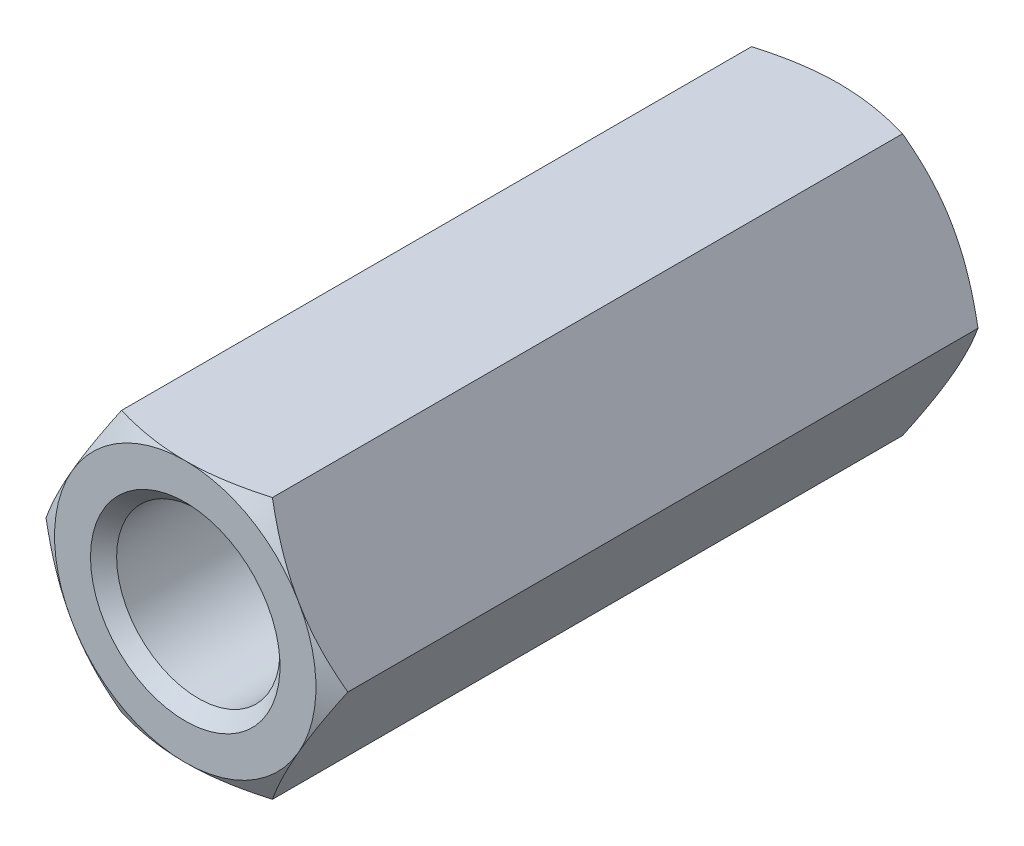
ISO-10303-21;
HEADER;
FILE_DESCRIPTION(('STEP AP214'),'2;1');
FILE_NAME('part.step','',(''),(''),'','','');
FILE_SCHEMA(('AUTOMOTIVE_DESIGN { 1 0 10303 214 1 1 1 1 }'));
ENDSEC;
DATA;
#1=APPLICATION_CONTEXT('core data for automotive mechanical design processes');
#2=APPLICATION_PROTOCOL_DEFINITION('international standard','automotive_design',2000,#1);
#3=PRODUCT_CONTEXT('',#1,'mechanical');
#4=PRODUCT('Part','Part','',(#3));
#5=PRODUCT_RELATED_PRODUCT_CATEGORY('part','',(#4));
#6=PRODUCT_DEFINITION_FORMATION('','',#4);
#7=PRODUCT_DEFINITION_CONTEXT('part definition',#1,'design');
#8=PRODUCT_DEFINITION('design','',#6,#7);
#9=PRODUCT_DEFINITION_SHAPE('','',#8);
#10=(LENGTH_UNIT() NAMED_UNIT(*) SI_UNIT(.MILLI.,.METRE.));
#11=(NAMED_UNIT(*) PLANE_ANGLE_UNIT() SI_UNIT($,.RADIAN.));
#12=(NAMED_UNIT(*) SI_UNIT($,.STERADIAN.) SOLID_ANGLE_UNIT());
#13=UNCERTAINTY_MEASURE_WITH_UNIT(LENGTH_MEASURE(1.E-05),#10,'distance_accuracy_value','');
#14=(GEOMETRIC_REPRESENTATION_CONTEXT(3) GLOBAL_UNCERTAINTY_ASSIGNED_CONTEXT((#13)) GLOBAL_UNIT_ASSIGNED_CONTEXT((#10,
#11,#12)) REPRESENTATION_CONTEXT('',''));
#15=CARTESIAN_POINT('',(0.,0.,0.));
#16=DIRECTION('',(0.,0.,1.));
#17=DIRECTION('',(1.,0.,0.));
#18=AXIS2_PLACEMENT_3D('',#15,#16,#17);
#19=CARTESIAN_POINT('',(4.61880215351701,0.,-10.));
#20=DIRECTION('',(0.866025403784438,0.5,0.));
#21=DIRECTION('',(-0.5,0.866025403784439,0.));
#22=AXIS2_PLACEMENT_3D('',#19,#20,#21);
#23=PLANE('',#22);
#24=CARTESIAN_POINT('',(4.61891762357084,-0.000199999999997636,9.64266774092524));
#25=CARTESIAN_POINT('',(4.51743148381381,0.175579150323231,9.70128212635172));
#26=CARTESIAN_POINT('',(4.41506932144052,0.352875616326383,9.75458967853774));
#27=CARTESIAN_POINT('',(4.20857250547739,0.710538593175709,9.8476383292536));
#28=CARTESIAN_POINT('',(4.10443418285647,0.890911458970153,9.8873465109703));
#29=CARTESIAN_POINT('',(3.89744813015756,1.24942181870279,9.94915778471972));
#30=CARTESIAN_POINT('',(3.79463224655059,1.42750415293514,9.97167226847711));
#31=CARTESIAN_POINT('',(3.58851671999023,1.78450671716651,9.99854937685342));
#32=CARTESIAN_POINT('',(3.48521782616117,1.9634256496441,10.0029342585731));
#33=CARTESIAN_POINT('',(3.29219970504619,2.29774284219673,9.99380992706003));
#34=CARTESIAN_POINT('',(3.20245157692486,2.45319115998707,9.98254104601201));
#35=CARTESIAN_POINT('',(3.02354002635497,2.76307505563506,9.94682600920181));
#36=CARTESIAN_POINT('',(2.93437722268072,2.91750956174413,9.92236765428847));
#37=CARTESIAN_POINT('',(2.75509682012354,3.22803232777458,9.86122393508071));
#38=CARTESIAN_POINT('',(2.6650019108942,3.3840812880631,9.82427939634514));
#39=CARTESIAN_POINT('',(2.48615580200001,3.69385183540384,9.74042992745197));
#40=CARTESIAN_POINT('',(2.39740231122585,3.84757739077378,9.69354469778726));
#41=CARTESIAN_POINT('',(2.30928560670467,4.0002,9.64266774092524));
#42=B_SPLINE_CURVE_WITH_KNOTS('',3,(#24,#25,#26,#27,#28,#29,#30,#31,#32,#33,#34,#35,#36,#37,#38,
#39,#40,#41),.UNSPECIFIED.,.F.,.F.,(4,2,2,2,2,2,2,2,4),(0.,0.634047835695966,1.26961969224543,
1.88946157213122,2.50854226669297,3.04757825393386,3.58711366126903,4.13861653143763,
4.68903648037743),.UNSPECIFIED.);
#43=CARTESIAN_POINT('',(4.61880215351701,0.,9.64273441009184));
#44=VERTEX_POINT('',#43);
#45=CARTESIAN_POINT('',(3.46410161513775,2.,10.));
#46=VERTEX_POINT('',#45);
#47=EDGE_CURVE('E127',#44,#46,#42,.T.);
#48=ORIENTED_EDGE('',*,*,#47,.F.);
#49=DIRECTION('',(0.,0.,1.));
#50=VECTOR('',#49,1.);
#51=CARTESIAN_POINT('',(4.61880215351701,0.,-10.));
#52=LINE('',#51,#50);
#53=CARTESIAN_POINT('',(4.61880215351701,0.,-9.64273441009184));
#54=VERTEX_POINT('',#53);
#55=EDGE_CURVE('E544',#54,#44,#52,.T.);
#56=ORIENTED_EDGE('',*,*,#55,.F.);
#57=CARTESIAN_POINT('',(4.61891762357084,-0.000199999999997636,-9.64266774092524));
#58=CARTESIAN_POINT('',(4.51743148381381,0.175579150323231,-9.70128212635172));
#59=CARTESIAN_POINT('',(4.41506932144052,0.352875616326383,-9.75458967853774));
#60=CARTESIAN_POINT('',(4.20857250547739,0.710538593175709,-9.8476383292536));
#61=CARTESIAN_POINT('',(4.10443418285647,0.890911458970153,-9.8873465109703));
#62=CARTESIAN_POINT('',(3.89744813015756,1.24942181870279,-9.94915778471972));
#63=CARTESIAN_POINT('',(3.79463224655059,1.42750415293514,-9.97167226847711));
#64=CARTESIAN_POINT('',(3.58851671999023,1.78450671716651,-9.99854937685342));
#65=CARTESIAN_POINT('',(3.48521782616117,1.9634256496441,-10.0029342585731));
#66=CARTESIAN_POINT('',(3.29219970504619,2.29774284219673,-9.99380992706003));
#67=CARTESIAN_POINT('',(3.20245157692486,2.45319115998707,-9.98254104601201));
#68=CARTESIAN_POINT('',(3.02354002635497,2.76307505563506,-9.94682600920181));
#69=CARTESIAN_POINT('',(2.93437722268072,2.91750956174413,-9.92236765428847));
#70=CARTESIAN_POINT('',(2.75509682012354,3.22803232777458,-9.86122393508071));
#71=CARTESIAN_POINT('',(2.6650019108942,3.3840812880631,-9.82427939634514));
#72=CARTESIAN_POINT('',(2.48615580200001,3.69385183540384,-9.74042992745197));
#73=CARTESIAN_POINT('',(2.39740231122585,3.84757739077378,-9.69354469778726));
#74=CARTESIAN_POINT('',(2.30928560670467,4.0002,-9.64266774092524));
#75=B_SPLINE_CURVE_WITH_KNOTS('',3,(#57,#58,#59,#60,#61,#62,#63,#64,#65,#66,#67,#68,#69,#70,#71,
#72,#73,#74),.UNSPECIFIED.,.F.,.F.,(4,2,2,2,2,2,2,2,4),(0.,0.634047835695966,1.26961969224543,
1.88946157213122,2.50854226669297,3.04757825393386,3.58711366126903,4.13861653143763,
4.68903648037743),.UNSPECIFIED.);
#76=CARTESIAN_POINT('',(3.46410161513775,2.,-10.));
#77=VERTEX_POINT('',#76);
#78=EDGE_CURVE('E546',#54,#77,#75,.T.);
#79=ORIENTED_EDGE('',*,*,#78,.T.);
#80=CARTESIAN_POINT('',(2.3094010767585,4.,-9.64273441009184));
#81=VERTEX_POINT('',#80);
#82=EDGE_CURVE('E268',#77,#81,#75,.T.);
#83=ORIENTED_EDGE('',*,*,#82,.T.);
#84=DIRECTION('',(0.,0.,1.));
#85=VECTOR('',#84,1.);
#86=CARTESIAN_POINT('',(2.3094010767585,4.,-10.));
#87=LINE('',#86,#85);
#88=CARTESIAN_POINT('',(2.3094010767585,4.,9.64273441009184));
#89=VERTEX_POINT('',#88);
#90=EDGE_CURVE('E159',#81,#89,#87,.T.);
#91=ORIENTED_EDGE('',*,*,#90,.T.);
#92=EDGE_CURVE('E140',#46,#89,#42,.T.);
#93=ORIENTED_EDGE('',*,*,#92,.F.);
#94=EDGE_LOOP('',(#48,#56,#79,#83,#91,#93));
#95=FACE_BOUND('',#94,.T.);
#96=ADVANCED_FACE('F41',(#95),#23,.T.);
#97=CARTESIAN_POINT('',(2.3094010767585,-4.,-10.));
#98=DIRECTION('',(0.866025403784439,-0.5,0.));
#99=DIRECTION('',(0.5,0.866025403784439,0.));
#100=AXIS2_PLACEMENT_3D('',#97,#98,#99);
#101=PLANE('',#100);
#102=CARTESIAN_POINT('',(2.30928560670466,-4.0002,9.64266774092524));
#103=CARTESIAN_POINT('',(2.4107717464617,-3.82442084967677,9.70128212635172));
#104=CARTESIAN_POINT('',(2.51313390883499,-3.64712438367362,9.75458967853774));
#105=CARTESIAN_POINT('',(2.71963072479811,-3.28946140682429,9.8476383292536));
#106=CARTESIAN_POINT('',(2.82376904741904,-3.10908854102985,9.8873465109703));
#107=CARTESIAN_POINT('',(3.03075510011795,-2.75057818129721,9.94915778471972));
#108=CARTESIAN_POINT('',(3.13357098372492,-2.57249584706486,9.97167226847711));
#109=CARTESIAN_POINT('',(3.33968651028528,-2.21549328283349,9.99854937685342));
#110=CARTESIAN_POINT('',(3.44298540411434,-2.0365743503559,10.0029342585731));
#111=CARTESIAN_POINT('',(3.63600352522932,-1.70225715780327,9.99380992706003));
#112=CARTESIAN_POINT('',(3.72575165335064,-1.54680884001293,9.98254104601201));
#113=CARTESIAN_POINT('',(3.90466320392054,-1.23692494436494,9.94682600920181));
#114=CARTESIAN_POINT('',(3.99382600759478,-1.08249043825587,9.92236765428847));
#115=CARTESIAN_POINT('',(4.17310641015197,-0.771967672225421,9.86122393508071));
#116=CARTESIAN_POINT('',(4.26320131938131,-0.615918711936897,9.82427939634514));
#117=CARTESIAN_POINT('',(4.4420474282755,-0.306148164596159,9.74042992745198));
#118=CARTESIAN_POINT('',(4.53080091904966,-0.152422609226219,9.69354469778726));
#119=CARTESIAN_POINT('',(4.61891762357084,0.00020000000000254,9.64266774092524));
#120=B_SPLINE_CURVE_WITH_KNOTS('',3,(#102,#103,#104,#105,#106,#107,#108,#109,#110,#111,#112,
#113,#114,#115,#116,#117,#118,#119),.UNSPECIFIED.,.F.,.F.,(4,2,2,2,2,2,2,2,4),(0.,
0.634047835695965,1.26961969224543,1.88946157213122,2.50854226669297,3.04757825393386,
3.58711366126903,4.13861653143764,4.68903648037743),.UNSPECIFIED.);
#121=CARTESIAN_POINT('',(2.3094010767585,-4.,9.64273441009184));
#122=VERTEX_POINT('',#121);
#123=CARTESIAN_POINT('',(3.46410161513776,-2.,10.));
#124=VERTEX_POINT('',#123);
#125=EDGE_CURVE('E534',#122,#124,#120,.T.);
#126=ORIENTED_EDGE('',*,*,#125,.F.);
#127=DIRECTION('',(0.,0.,1.));
#128=VECTOR('',#127,1.);
#129=CARTESIAN_POINT('',(2.3094010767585,-4.,-10.));
#130=LINE('',#129,#128);
#131=CARTESIAN_POINT('',(2.3094010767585,-4.,-9.64273441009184));
#132=VERTEX_POINT('',#131);
#133=EDGE_CURVE('E282',#132,#122,#130,.T.);
#134=ORIENTED_EDGE('',*,*,#133,.F.);
#135=CARTESIAN_POINT('',(2.30928560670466,-4.0002,-9.64266774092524));
#136=CARTESIAN_POINT('',(2.4107717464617,-3.82442084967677,-9.70128212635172));
#137=CARTESIAN_POINT('',(2.51313390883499,-3.64712438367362,-9.75458967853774));
#138=CARTESIAN_POINT('',(2.71963072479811,-3.28946140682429,-9.8476383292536));
#139=CARTESIAN_POINT('',(2.82376904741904,-3.10908854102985,-9.8873465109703));
#140=CARTESIAN_POINT('',(3.03075510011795,-2.75057818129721,-9.94915778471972));
#141=CARTESIAN_POINT('',(3.13357098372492,-2.57249584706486,-9.97167226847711));
#142=CARTESIAN_POINT('',(3.33968651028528,-2.21549328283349,-9.99854937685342));
#143=CARTESIAN_POINT('',(3.44298540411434,-2.0365743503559,-10.0029342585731));
#144=CARTESIAN_POINT('',(3.63600352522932,-1.70225715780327,-9.99380992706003));
#145=CARTESIAN_POINT('',(3.72575165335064,-1.54680884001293,-9.98254104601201));
#146=CARTESIAN_POINT('',(3.90466320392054,-1.23692494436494,-9.94682600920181));
#147=CARTESIAN_POINT('',(3.99382600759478,-1.08249043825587,-9.92236765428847));
#148=CARTESIAN_POINT('',(4.17310641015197,-0.771967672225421,-9.86122393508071));
#149=CARTESIAN_POINT('',(4.26320131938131,-0.615918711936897,-9.82427939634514));
#150=CARTESIAN_POINT('',(4.4420474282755,-0.306148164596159,-9.74042992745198));
#151=CARTESIAN_POINT('',(4.53080091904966,-0.152422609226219,-9.69354469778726));
#152=CARTESIAN_POINT('',(4.61891762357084,0.00020000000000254,-9.64266774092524));
#153=B_SPLINE_CURVE_WITH_KNOTS('',3,(#135,#136,#137,#138,#139,#140,#141,#142,#143,#144,#145,
#146,#147,#148,#149,#150,#151,#152),.UNSPECIFIED.,.F.,.F.,(4,2,2,2,2,2,2,2,4),(0.,
0.634047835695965,1.26961969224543,1.88946157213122,2.50854226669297,3.04757825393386,
3.58711366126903,4.13861653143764,4.68903648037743),.UNSPECIFIED.);
#154=CARTESIAN_POINT('',(3.46410161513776,-2.,-10.));
#155=VERTEX_POINT('',#154);
#156=EDGE_CURVE('E545',#132,#155,#153,.T.);
#157=ORIENTED_EDGE('',*,*,#156,.T.);
#158=EDGE_CURVE('E283',#155,#54,#153,.T.);
#159=ORIENTED_EDGE('',*,*,#158,.T.);
#160=ORIENTED_EDGE('',*,*,#55,.T.);
#161=EDGE_CURVE('E132',#124,#44,#120,.T.);
#162=ORIENTED_EDGE('',*,*,#161,.F.);
#163=EDGE_LOOP('',(#126,#134,#157,#159,#160,#162));
#164=FACE_BOUND('',#163,.T.);
#165=ADVANCED_FACE('F253',(#164),#101,.T.);
#166=CARTESIAN_POINT('',(-2.3094010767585,-4.,-10.));
#167=DIRECTION('',(0.,-1.,0.));
#168=DIRECTION('',(0.,0.,-1.));
#169=AXIS2_PLACEMENT_3D('',#166,#167,#168);
#170=PLANE('',#169);
#171=CARTESIAN_POINT('',(-17.8108056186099,-4.,1.7701917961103));
#172=CARTESIAN_POINT('',(-17.4231435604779,-4.,1.98856120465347));
#173=CARTESIAN_POINT('',(-17.0353413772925,-4.,2.20668239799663));
#174=CARTESIAN_POINT('',(-16.2593791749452,-4.,2.64229075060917));
#175=CARTESIAN_POINT('',(-15.8712191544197,-4.,2.85977790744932));
#176=CARTESIAN_POINT('',(-15.0943874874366,-4.,3.294023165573));
#177=CARTESIAN_POINT('',(-14.7057157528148,-4.,3.51078110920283));
#178=CARTESIAN_POINT('',(-13.9278336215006,-4.,3.9433271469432));
#179=CARTESIAN_POINT('',(-13.5386232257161,-4.,4.1591152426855));
#180=CARTESIAN_POINT('',(-12.7617286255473,-4.,4.58823972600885));
#181=CARTESIAN_POINT('',(-12.3740482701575,-4.,4.80158307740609));
#182=CARTESIAN_POINT('',(-11.5978227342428,-4.,5.2266901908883));
#183=CARTESIAN_POINT('',(-11.2092775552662,-4.,5.43845395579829));
#184=CARTESIAN_POINT('',(-10.431096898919,-4.,5.85986514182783));
#185=CARTESIAN_POINT('',(-10.0414615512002,-4.,6.06951280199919));
#186=CARTESIAN_POINT('',(-9.26067086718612,-4.,6.48595211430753));
#187=CARTESIAN_POINT('',(-8.86951554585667,-4.,6.69274379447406));
#188=CARTESIAN_POINT('',(-8.07519273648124,-4.,7.10750777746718));
#189=CARTESIAN_POINT('',(-7.67197156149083,-4.,7.31537776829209));
#190=CARTESIAN_POINT('',(-7.06472102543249,-4.,7.62250922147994));
#191=CARTESIAN_POINT('',(-6.86187947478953,-4.,7.72411794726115));
#192=CARTESIAN_POINT('',(-6.45522863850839,-4.,7.92537786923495));
#193=CARTESIAN_POINT('',(-6.25141936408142,-4.,8.02502908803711));
#194=CARTESIAN_POINT('',(-5.84125807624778,-4.,8.22253566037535));
#195=CARTESIAN_POINT('',(-5.63489816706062,-4.,8.32037465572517));
#196=CARTESIAN_POINT('',(-5.22070788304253,-4.,8.51288143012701));
#197=CARTESIAN_POINT('',(-5.01287755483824,-4.,8.6075493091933));
#198=CARTESIAN_POINT('',(-4.59543688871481,-4.,8.79276485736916));
#199=CARTESIAN_POINT('',(-4.38582696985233,-4.,8.88331346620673));
#200=CARTESIAN_POINT('',(-3.96436954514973,-4.,9.05901801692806));
#201=CARTESIAN_POINT('',(-3.75252223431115,-4.,9.14417442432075));
#202=CARTESIAN_POINT('',(-3.29653652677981,-4.,9.31863539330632));
#203=CARTESIAN_POINT('',(-3.05198777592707,-4.,9.40688226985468));
#204=CARTESIAN_POINT('',(-2.55851043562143,-4.,9.57047532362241));
#205=CARTESIAN_POINT('',(-2.3095812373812,-4.,9.6458196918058));
#206=CARTESIAN_POINT('',(-1.81007791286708,-4.,9.77774175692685));
#207=CARTESIAN_POINT('',(-1.55956719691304,-4.,9.83455059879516));
#208=CARTESIAN_POINT('',(-1.18075305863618,-4.,9.90248348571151));
#209=CARTESIAN_POINT('',(-1.05398563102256,-4.,9.92224668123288));
#210=CARTESIAN_POINT('',(-0.799627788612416,-4.,9.95539236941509));
#211=CARTESIAN_POINT('',(-0.672037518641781,-4.,9.96877595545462));
#212=CARTESIAN_POINT('',(-0.413939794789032,-4.,9.98886248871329));
#213=CARTESIAN_POINT('',(-0.283422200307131,-4.,9.99543663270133));
#214=CARTESIAN_POINT('',(-0.0222228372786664,-4.,10.0011936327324));
#215=CARTESIAN_POINT('',(0.108458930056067,-4.,10.0003765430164));
#216=CARTESIAN_POINT('',(0.369574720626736,-4.,9.99138493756));
#217=CARTESIAN_POINT('',(0.500008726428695,-4.,9.98320992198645));
#218=CARTESIAN_POINT('',(0.760241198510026,-4.,9.95983097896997));
#219=CARTESIAN_POINT('',(0.890039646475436,-4.,9.94462685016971));
#220=CARTESIAN_POINT('',(1.15029888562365,-4.,9.90752103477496));
#221=CARTESIAN_POINT('',(1.28074811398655,-4.,9.88553908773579));
#222=CARTESIAN_POINT('',(1.54050277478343,-4.,9.83566308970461));
#223=CARTESIAN_POINT('',(1.66980818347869,-4.,9.80776891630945));
#224=CARTESIAN_POINT('',(1.92724730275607,-4.,9.74681864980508));
#225=CARTESIAN_POINT('',(2.05538047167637,-4.,9.71376028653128));
#226=CARTESIAN_POINT('',(2.3104084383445,-4.,9.64322618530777));
#227=CARTESIAN_POINT('',(2.43730329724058,-4.,9.60575066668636));
#228=CARTESIAN_POINT('',(2.77800839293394,-4.,9.49961572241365));
#229=CARTESIAN_POINT('',(2.99072077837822,-4.,9.42743436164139));
#230=CARTESIAN_POINT('',(3.41324611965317,-4.,9.27498398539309));
#231=CARTESIAN_POINT('',(3.62305827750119,-4.,9.19471279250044));
#232=CARTESIAN_POINT('',(4.0404398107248,-4.,9.02801757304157));
#233=CARTESIAN_POINT('',(4.2480068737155,-4.,8.94158779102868));
#234=CARTESIAN_POINT('',(4.66112607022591,-4.,8.76411930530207));
#235=CARTESIAN_POINT('',(4.86667839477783,-4.,8.67308104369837));
#236=CARTESIAN_POINT('',(5.27669988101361,-4.,8.48721091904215));
#237=CARTESIAN_POINT('',(5.48116483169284,-4.,8.39236979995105));
#238=CARTESIAN_POINT('',(5.88877966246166,-4.,8.19990056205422));
#239=CARTESIAN_POINT('',(6.09192951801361,-4.,8.10227239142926));
#240=CARTESIAN_POINT('',(6.49704451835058,-4.,7.90486582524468));
#241=CARTESIAN_POINT('',(6.69901024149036,-4.,7.80508861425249));
#242=CARTESIAN_POINT('',(7.10205847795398,-4.,7.60376424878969));
#243=CARTESIAN_POINT('',(7.30314098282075,-4.,7.50221707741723));
#244=CARTESIAN_POINT('',(7.90688497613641,-4.,7.19462921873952));
#245=CARTESIAN_POINT('',(8.30844516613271,-4.,6.9864277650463));
#246=CARTESIAN_POINT('',(9.10956165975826,-4.,6.56610489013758));
#247=CARTESIAN_POINT('',(9.50911771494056,-4.,6.35398299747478));
#248=CARTESIAN_POINT('',(10.3061197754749,-4.,5.92729324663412));
#249=CARTESIAN_POINT('',(10.7035680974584,-4.,5.71272971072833));
#250=CARTESIAN_POINT('',(11.4973607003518,-4.,5.28156952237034));
#251=CARTESIAN_POINT('',(11.8937049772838,-4.,5.06497286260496));
#252=CARTESIAN_POINT('',(12.7529183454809,-4.,4.59326334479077));
#253=CARTESIAN_POINT('',(13.2156320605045,-4.,4.33786765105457));
#254=CARTESIAN_POINT('',(14.1403827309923,-4.,3.82542331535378));
#255=CARTESIAN_POINT('',(14.6024193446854,-4.,3.56837405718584));
#256=CARTESIAN_POINT('',(15.5225586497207,-4.,3.0549258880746));
#257=CARTESIAN_POINT('',(15.9806659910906,-4.,2.79853530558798));
#258=CARTESIAN_POINT('',(16.8961808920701,-4.,2.28493935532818));
#259=CARTESIAN_POINT('',(17.3535886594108,-4.,2.02773435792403));
#260=CARTESIAN_POINT('',(17.8108056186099,-4.,1.7701917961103));
#261=B_SPLINE_CURVE_WITH_KNOTS('',3,(#171,#172,#173,#174,#175,#176,#177,#178,#179,#180,#181,
#182,#183,#184,#185,#186,#187,#188,#189,#190,#191,#192,#193,#194,#195,#196,#197,#198,#199,#200,
#201,#202,#203,#204,#205,#206,#207,#208,#209,#210,#211,#212,#213,#214,#215,#216,#217,#218,#219,
#220,#221,#222,#223,#224,#225,#226,#227,#228,#229,#230,#231,#232,#233,#234,#235,#236,#237,#238,
#239,#240,#241,#242,#243,#244,#245,#246,#247,#248,#249,#250,#251,#252,#253,#254,#255,#256,#257,
#258,#259,#260),.UNSPECIFIED.,.F.,.F.,(4,2,2,2,2,2,2,2,2,2,2,2,2,2,2,2,2,2,2,2,2,2,2,2,2,2,2,2,
2,2,2,2,2,2,2,2,2,2,2,2,2,2,2,2,4),(0.,1.33480502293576,2.6696151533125,4.0046973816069,
5.33977736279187,6.66729215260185,7.9948045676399,9.32216529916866,10.6495129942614,
12.0104163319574,12.6910119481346,13.3715996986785,14.0567152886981,14.7418092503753,
15.4267461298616,16.1116237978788,16.8913116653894,17.6711087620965,18.4407726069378,
18.8255327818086,19.2102269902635,19.6020718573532,19.9939138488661,20.3857824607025,
20.7776622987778,21.1743734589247,21.5710928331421,21.9679870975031,22.3648616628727,
23.0384953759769,23.7123108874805,24.3867645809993,25.0611536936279,25.737297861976,
26.4134546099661,27.0892477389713,27.7650473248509,29.1219872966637,30.4790915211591,
31.8340828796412,33.1890791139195,34.7746279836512,36.3608065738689,37.9357296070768,
39.5100173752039),.UNSPECIFIED.);
#262=CARTESIAN_POINT('',(-2.3094010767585,-4.,9.64273441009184));
#263=VERTEX_POINT('',#262);
#264=CARTESIAN_POINT('',(0.,-4.,10.));
#265=VERTEX_POINT('',#264);
#266=EDGE_CURVE('E532',#263,#265,#261,.T.);
#267=ORIENTED_EDGE('',*,*,#266,.F.);
#268=DIRECTION('',(0.,0.,1.));
#269=VECTOR('',#268,1.);
#270=CARTESIAN_POINT('',(-2.3094010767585,-4.,-10.));
#271=LINE('',#270,#269);
#272=CARTESIAN_POINT('',(-2.3094010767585,-4.,-9.64273441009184));
#273=VERTEX_POINT('',#272);
#274=EDGE_CURVE('E541',#273,#263,#271,.T.);
#275=ORIENTED_EDGE('',*,*,#274,.F.);
#276=CARTESIAN_POINT('',(-11.5279836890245,-4.,-5.2644405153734));
#277=CARTESIAN_POINT('',(-11.2715120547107,-4.,-5.4043217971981));
#278=CARTESIAN_POINT('',(-11.014837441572,-4.,-5.5438326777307));
#279=CARTESIAN_POINT('',(-10.5009754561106,-4.,-5.82191693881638));
#280=CARTESIAN_POINT('',(-10.2437880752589,-4.,-5.96049030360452));
#281=CARTESIAN_POINT('',(-9.72862819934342,-4.,-6.23659146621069));
#282=CARTESIAN_POINT('',(-9.47065529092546,-4.,-6.37411849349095));
#283=CARTESIAN_POINT('',(-8.95395916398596,-4.,-6.64775277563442));
#284=CARTESIAN_POINT('',(-8.69523595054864,-4.,-6.78386004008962));
#285=CARTESIAN_POINT('',(-8.16951167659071,-4.,-7.05811973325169));
#286=CARTESIAN_POINT('',(-7.90248379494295,-4.,-7.19622082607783));
#287=CARTESIAN_POINT('',(-7.36718088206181,-4.,-7.46998268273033));
#288=CARTESIAN_POINT('',(-7.09890586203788,-4.,-7.60564346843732));
#289=CARTESIAN_POINT('',(-6.56082622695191,-4.,-7.87371521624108));
#290=CARTESIAN_POINT('',(-6.29102206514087,-4.,-8.00612708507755));
#291=CARTESIAN_POINT('',(-5.74933668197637,-4.,-8.26661334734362));
#292=CARTESIAN_POINT('',(-5.47745554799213,-4.,-8.39468792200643));
#293=CARTESIAN_POINT('',(-4.92135065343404,-4.,-8.64926272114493));
#294=CARTESIAN_POINT('',(-4.6370284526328,-4.,-8.77555017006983));
#295=CARTESIAN_POINT('',(-4.20754891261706,-4.,-8.95807487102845));
#296=CARTESIAN_POINT('',(-4.06386416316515,-4.,-9.01777524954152));
#297=CARTESIAN_POINT('',(-3.77535865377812,-4.,-9.13435814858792));
#298=CARTESIAN_POINT('',(-3.63053794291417,-4.,-9.19124079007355));
#299=CARTESIAN_POINT('',(-3.34059820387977,-4.,-9.30120468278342));
#300=CARTESIAN_POINT('',(-3.19548814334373,-4.,-9.35430947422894));
#301=CARTESIAN_POINT('',(-2.90381608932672,-4.,-9.45640888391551));
#302=CARTESIAN_POINT('',(-2.75725404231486,-4.,-9.50540334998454));
#303=CARTESIAN_POINT('',(-2.46259054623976,-4.,-9.59836548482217));
#304=CARTESIAN_POINT('',(-2.31448970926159,-4.,-9.64233507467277));
#305=CARTESIAN_POINT('',(-2.01662643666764,-4.,-9.72421146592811));
#306=CARTESIAN_POINT('',(-1.86686405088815,-4.,-9.76211844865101));
#307=CARTESIAN_POINT('',(-1.49841751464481,-4.,-9.84598275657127));
#308=CARTESIAN_POINT('',(-1.2787913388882,-4.,-9.88798746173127));
#309=CARTESIAN_POINT('',(-0.947334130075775,-4.,-9.93691975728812));
#310=CARTESIAN_POINT('',(-0.83651866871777,-4.,-9.95088431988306));
#311=CARTESIAN_POINT('',(-0.614371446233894,-4.,-9.97376962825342));
#312=CARTESIAN_POINT('',(-0.503039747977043,-4.,-9.98269097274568));
#313=CARTESIAN_POINT('',(-0.280424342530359,-4.,-9.99521270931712));
#314=CARTESIAN_POINT('',(-0.169141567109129,-4.,-9.99882959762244));
#315=CARTESIAN_POINT('',(0.053468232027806,-4.,-10.0006876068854));
#316=CARTESIAN_POINT('',(0.16479525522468,-4.,-9.99892878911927));
#317=CARTESIAN_POINT('',(0.387249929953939,-4.,-9.99008741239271));
#318=CARTESIAN_POINT('',(0.498377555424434,-4.,-9.98300420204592));
#319=CARTESIAN_POINT('',(0.720190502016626,-4.,-9.96372103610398));
#320=CARTESIAN_POINT('',(0.830875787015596,-4.,-9.95152067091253));
#321=CARTESIAN_POINT('',(1.09884160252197,-4.,-9.91608140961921));
#322=CARTESIAN_POINT('',(1.25579519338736,-4.,-9.89035300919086));
#323=CARTESIAN_POINT('',(1.56805927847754,-4.,-9.83034903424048));
#324=CARTESIAN_POINT('',(1.72336945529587,-4.,-9.79607183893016));
#325=CARTESIAN_POINT('',(2.03236005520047,-4.,-9.72026345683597));
#326=CARTESIAN_POINT('',(2.18603864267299,-4.,-9.67872486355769));
#327=CARTESIAN_POINT('',(2.49163073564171,-4.,-9.58966949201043));
#328=CARTESIAN_POINT('',(2.64354431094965,-4.,-9.54215295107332));
#329=CARTESIAN_POINT('',(2.94842578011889,-4.,-9.44134014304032));
#330=CARTESIAN_POINT('',(3.10136449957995,-4.,-9.38795623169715));
#331=CARTESIAN_POINT('',(3.40573396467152,-4.,-9.27707035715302));
#332=CARTESIAN_POINT('',(3.55716470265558,-4.,-9.21956837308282));
#333=CARTESIAN_POINT('',(3.85861478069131,-4.,-9.10125036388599));
#334=CARTESIAN_POINT('',(4.00863491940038,-4.,-9.0404363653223));
#335=CARTESIAN_POINT('',(4.30753677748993,-4.,-8.91606609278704));
#336=CARTESIAN_POINT('',(4.45641845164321,-4.,-8.85250971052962));
#337=CARTESIAN_POINT('',(4.91043290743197,-4.,-8.65463397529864));
#338=CARTESIAN_POINT('',(5.21398386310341,-4.,-8.51668753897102));
#339=CARTESIAN_POINT('',(5.8180658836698,-4.,-8.23432963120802));
#340=CARTESIAN_POINT('',(6.1185966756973,-4.,-8.08991758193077));
#341=CARTESIAN_POINT('',(6.71756026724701,-4.,-7.79643693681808));
#342=CARTESIAN_POINT('',(7.01599191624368,-4.,-7.64736599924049));
#343=CARTESIAN_POINT('',(7.61116391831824,-4.,-7.34588529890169));
#344=CARTESIAN_POINT('',(7.90790424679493,-4.,-7.19347548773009));
#345=CARTESIAN_POINT('',(8.48290085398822,-4.,-6.89507766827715));
#346=CARTESIAN_POINT('',(8.76123029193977,-4.,-6.74923038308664));
#347=CARTESIAN_POINT('',(9.3169822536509,-4.,-6.45581152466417));
#348=CARTESIAN_POINT('',(9.59440476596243,-4.,-6.3082399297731));
#349=CARTESIAN_POINT('',(10.1481927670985,-4.,-6.01191517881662));
#350=CARTESIAN_POINT('',(10.4245591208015,-4.,-5.86316363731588));
#351=CARTESIAN_POINT('',(10.9766890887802,-4.,-5.56456293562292));
#352=CARTESIAN_POINT('',(11.2524527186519,-4.,-5.41471380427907));
#353=CARTESIAN_POINT('',(11.5279836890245,-4.,-5.2644405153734));
#354=B_SPLINE_CURVE_WITH_KNOTS('',3,(#276,#277,#278,#279,#280,#281,#282,#283,#284,#285,#286,
#287,#288,#289,#290,#291,#292,#293,#294,#295,#296,#297,#298,#299,#300,#301,#302,#303,#304,#305,
#306,#307,#308,#309,#310,#311,#312,#313,#314,#315,#316,#317,#318,#319,#320,#321,#322,#323,#324,
#325,#326,#327,#328,#329,#330,#331,#332,#333,#334,#335,#336,#337,#338,#339,#340,#341,#342,#343,
#344,#345,#346,#347,#348,#349,#350,#351,#352,#353),.UNSPECIFIED.,.F.,.F.,(4,2,2,2,2,2,2,2,2,2,2,
2,2,2,2,2,2,2,2,2,2,2,2,2,2,2,2,2,2,2,2,2,2,2,2,2,2,2,4),(0.,0.876414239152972,1.75284317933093,
2.62986487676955,3.50688064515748,4.40874802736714,5.31060731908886,6.21221198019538,
7.11377892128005,8.04696753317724,8.51372602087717,8.98046445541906,9.44397948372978,
9.90751166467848,10.3708660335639,10.8342065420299,11.5042466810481,11.8392272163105,
12.1741679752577,12.5080648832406,12.8419579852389,13.17589194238,13.5098526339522,
13.986706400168,14.4636506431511,14.9410842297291,15.4184988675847,15.904390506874,
16.3902846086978,16.8758846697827,17.361503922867,18.3616495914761,19.3618848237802,
20.3626311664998,21.3633920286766,22.3060660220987,23.2487518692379,24.1903162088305,
25.1318558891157),.UNSPECIFIED.);
#355=CARTESIAN_POINT('',(0.,-4.,-10.));
#356=VERTEX_POINT('',#355);
#357=EDGE_CURVE('E564',#273,#356,#354,.T.);
#358=ORIENTED_EDGE('',*,*,#357,.T.);
#359=EDGE_CURVE('E258',#356,#132,#354,.T.);
#360=ORIENTED_EDGE('',*,*,#359,.T.);
#361=ORIENTED_EDGE('',*,*,#133,.T.);
#362=EDGE_CURVE('E138',#265,#122,#261,.T.);
#363=ORIENTED_EDGE('',*,*,#362,.F.);
#364=EDGE_LOOP('',(#267,#275,#358,#360,#361,#363));
#365=FACE_BOUND('',#364,.T.);
#366=ADVANCED_FACE('F291',(#365),#170,.T.);
#367=CARTESIAN_POINT('',(-4.61880215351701,0.,-10.));
#368=DIRECTION('',(-0.866025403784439,-0.5,0.));
#369=DIRECTION('',(0.5,-0.866025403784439,0.));
#370=AXIS2_PLACEMENT_3D('',#367,#368,#369);
#371=PLANE('',#370);
#372=CARTESIAN_POINT('',(-4.61891762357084,0.000200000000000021,9.64266774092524));
#373=CARTESIAN_POINT('',(-4.51743148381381,-0.175579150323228,9.70128212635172));
#374=CARTESIAN_POINT('',(-4.41506932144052,-0.352875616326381,9.75458967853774));
#375=CARTESIAN_POINT('',(-4.20857250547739,-0.710538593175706,9.8476383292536));
#376=CARTESIAN_POINT('',(-4.10443418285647,-0.890911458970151,9.8873465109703));
#377=CARTESIAN_POINT('',(-3.89744813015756,-1.24942181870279,9.94915778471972));
#378=CARTESIAN_POINT('',(-3.79463224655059,-1.42750415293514,9.97167226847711));
#379=CARTESIAN_POINT('',(-3.58851671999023,-1.78450671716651,9.99854937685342));
#380=CARTESIAN_POINT('',(-3.48521782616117,-1.9634256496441,10.0029342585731));
#381=CARTESIAN_POINT('',(-3.29219970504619,-2.29774284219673,9.99380992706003));
#382=CARTESIAN_POINT('',(-3.20245157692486,-2.45319115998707,9.98254104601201));
#383=CARTESIAN_POINT('',(-3.02354002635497,-2.76307505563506,9.94682600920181));
#384=CARTESIAN_POINT('',(-2.93437722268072,-2.91750956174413,9.92236765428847));
#385=CARTESIAN_POINT('',(-2.75509682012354,-3.22803232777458,9.86122393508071));
#386=CARTESIAN_POINT('',(-2.6650019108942,-3.3840812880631,9.82427939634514));
#387=CARTESIAN_POINT('',(-2.48615580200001,-3.69385183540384,9.74042992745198));
#388=CARTESIAN_POINT('',(-2.39740231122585,-3.84757739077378,9.69354469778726));
#389=CARTESIAN_POINT('',(-2.30928560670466,-4.0002,9.64266774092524));
#390=B_SPLINE_CURVE_WITH_KNOTS('',3,(#372,#373,#374,#375,#376,#377,#378,#379,#380,#381,#382,
#383,#384,#385,#386,#387,#388,#389),.UNSPECIFIED.,.F.,.F.,(4,2,2,2,2,2,2,2,4),(0.,
0.634047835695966,1.26961969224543,1.88946157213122,2.50854226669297,3.04757825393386,
3.58711366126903,4.13861653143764,4.68903648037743),.UNSPECIFIED.);
#391=CARTESIAN_POINT('',(-4.61880215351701,0.,9.64273441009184));
#392=VERTEX_POINT('',#391);
#393=CARTESIAN_POINT('',(-3.46410161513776,-2.,10.));
#394=VERTEX_POINT('',#393);
#395=EDGE_CURVE('E175',#392,#394,#390,.T.);
#396=ORIENTED_EDGE('',*,*,#395,.F.);
#397=DIRECTION('',(0.,0.,1.));
#398=VECTOR('',#397,1.);
#399=CARTESIAN_POINT('',(-4.61880215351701,0.,-10.));
#400=LINE('',#399,#398);
#401=CARTESIAN_POINT('',(-4.61880215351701,0.,-9.64273441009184));
#402=VERTEX_POINT('',#401);
#403=EDGE_CURVE('E560',#402,#392,#400,.T.);
#404=ORIENTED_EDGE('',*,*,#403,.F.);
#405=CARTESIAN_POINT('',(-4.61891762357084,0.000199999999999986,-9.64266774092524));
#406=CARTESIAN_POINT('',(-4.51743148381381,-0.175579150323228,-9.70128212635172));
#407=CARTESIAN_POINT('',(-4.41506932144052,-0.352875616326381,-9.75458967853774));
#408=CARTESIAN_POINT('',(-4.20857250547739,-0.710538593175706,-9.8476383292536));
#409=CARTESIAN_POINT('',(-4.10443418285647,-0.890911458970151,-9.8873465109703));
#410=CARTESIAN_POINT('',(-3.89744813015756,-1.24942181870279,-9.94915778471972));
#411=CARTESIAN_POINT('',(-3.79463224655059,-1.42750415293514,-9.97167226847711));
#412=CARTESIAN_POINT('',(-3.58851671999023,-1.78450671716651,-9.99854937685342));
#413=CARTESIAN_POINT('',(-3.48521782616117,-1.9634256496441,-10.0029342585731));
#414=CARTESIAN_POINT('',(-3.29219970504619,-2.29774284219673,-9.99380992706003));
#415=CARTESIAN_POINT('',(-3.20245157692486,-2.45319115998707,-9.98254104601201));
#416=CARTESIAN_POINT('',(-3.02354002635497,-2.76307505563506,-9.94682600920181));
#417=CARTESIAN_POINT('',(-2.93437722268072,-2.91750956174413,-9.92236765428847));
#418=CARTESIAN_POINT('',(-2.75509682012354,-3.22803232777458,-9.86122393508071));
#419=CARTESIAN_POINT('',(-2.6650019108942,-3.3840812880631,-9.82427939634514));
#420=CARTESIAN_POINT('',(-2.48615580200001,-3.69385183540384,-9.74042992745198));
#421=CARTESIAN_POINT('',(-2.39740231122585,-3.84757739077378,-9.69354469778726));
#422=CARTESIAN_POINT('',(-2.30928560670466,-4.0002,-9.64266774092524));
#423=B_SPLINE_CURVE_WITH_KNOTS('',3,(#405,#406,#407,#408,#409,#410,#411,#412,#413,#414,#415,
#416,#417,#418,#419,#420,#421,#422),.UNSPECIFIED.,.F.,.F.,(4,2,2,2,2,2,2,2,4),(0.,
0.634047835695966,1.26961969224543,1.88946157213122,2.50854226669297,3.04757825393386,
3.58711366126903,4.13861653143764,4.68903648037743),.UNSPECIFIED.);
#424=CARTESIAN_POINT('',(-3.46410161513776,-2.,-10.));
#425=VERTEX_POINT('',#424);
#426=EDGE_CURVE('E274',#402,#425,#423,.T.);
#427=ORIENTED_EDGE('',*,*,#426,.T.);
#428=EDGE_CURVE('E281',#425,#273,#423,.T.);
#429=ORIENTED_EDGE('',*,*,#428,.T.);
#430=ORIENTED_EDGE('',*,*,#274,.T.);
#431=EDGE_CURVE('E526',#394,#263,#390,.T.);
#432=ORIENTED_EDGE('',*,*,#431,.F.);
#433=EDGE_LOOP('',(#396,#404,#427,#429,#430,#432));
#434=FACE_BOUND('',#433,.T.);
#435=ADVANCED_FACE('F288',(#434),#371,.T.);
#436=CARTESIAN_POINT('',(-2.3094010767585,4.,-10.));
#437=DIRECTION('',(-0.866025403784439,0.5,0.));
#438=DIRECTION('',(-0.5,-0.866025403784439,0.));
#439=AXIS2_PLACEMENT_3D('',#436,#437,#438);
#440=PLANE('',#439);
#441=CARTESIAN_POINT('',(-2.30928560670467,4.0002,9.64266774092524));
#442=CARTESIAN_POINT('',(-2.41077174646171,3.82442084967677,9.70128212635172));
#443=CARTESIAN_POINT('',(-2.513133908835,3.64712438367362,9.75458967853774));
#444=CARTESIAN_POINT('',(-2.71963072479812,3.28946140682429,9.8476383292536));
#445=CARTESIAN_POINT('',(-2.82376904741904,3.10908854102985,9.8873465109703));
#446=CARTESIAN_POINT('',(-3.03075510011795,2.75057818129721,9.94915778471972));
#447=CARTESIAN_POINT('',(-3.13357098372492,2.57249584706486,9.97167226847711));
#448=CARTESIAN_POINT('',(-3.33968651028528,2.21549328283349,9.99854937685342));
#449=CARTESIAN_POINT('',(-3.44298540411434,2.0365743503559,10.0029342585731));
#450=CARTESIAN_POINT('',(-3.63600352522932,1.70225715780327,9.99380992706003));
#451=CARTESIAN_POINT('',(-3.72575165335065,1.54680884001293,9.98254104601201));
#452=CARTESIAN_POINT('',(-3.90466320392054,1.23692494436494,9.94682600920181));
#453=CARTESIAN_POINT('',(-3.99382600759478,1.08249043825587,9.92236765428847));
#454=CARTESIAN_POINT('',(-4.17310641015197,0.771967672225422,9.86122393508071));
#455=CARTESIAN_POINT('',(-4.26320131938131,0.615918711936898,9.82427939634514));
#456=CARTESIAN_POINT('',(-4.4420474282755,0.306148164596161,9.74042992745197));
#457=CARTESIAN_POINT('',(-4.53080091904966,0.152422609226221,9.69354469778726));
#458=CARTESIAN_POINT('',(-4.61891762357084,-0.00019999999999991,9.64266774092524));
#459=B_SPLINE_CURVE_WITH_KNOTS('',3,(#441,#442,#443,#444,#445,#446,#447,#448,#449,#450,#451,
#452,#453,#454,#455,#456,#457,#458),.UNSPECIFIED.,.F.,.F.,(4,2,2,2,2,2,2,2,4),(0.,
0.634047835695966,1.26961969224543,1.88946157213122,2.50854226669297,3.04757825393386,
3.58711366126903,4.13861653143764,4.68903648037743),.UNSPECIFIED.);
#460=CARTESIAN_POINT('',(-2.30940107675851,4.,9.64273441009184));
#461=VERTEX_POINT('',#460);
#462=CARTESIAN_POINT('',(-3.46410161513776,2.,10.));
#463=VERTEX_POINT('',#462);
#464=EDGE_CURVE('E182',#461,#463,#459,.T.);
#465=ORIENTED_EDGE('',*,*,#464,.F.);
#466=DIRECTION('',(0.,0.,1.));
#467=VECTOR('',#466,1.);
#468=CARTESIAN_POINT('',(-2.3094010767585,4.,-10.));
#469=LINE('',#468,#467);
#470=CARTESIAN_POINT('',(-2.3094010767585,4.,-9.64273441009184));
#471=VERTEX_POINT('',#470);
#472=EDGE_CURVE('E232',#471,#461,#469,.T.);
#473=ORIENTED_EDGE('',*,*,#472,.F.);
#474=CARTESIAN_POINT('',(-2.30928560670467,4.0002,-9.64266774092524));
#475=CARTESIAN_POINT('',(-2.41077174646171,3.82442084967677,-9.70128212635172));
#476=CARTESIAN_POINT('',(-2.513133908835,3.64712438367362,-9.75458967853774));
#477=CARTESIAN_POINT('',(-2.71963072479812,3.28946140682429,-9.8476383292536));
#478=CARTESIAN_POINT('',(-2.82376904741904,3.10908854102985,-9.8873465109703));
#479=CARTESIAN_POINT('',(-3.03075510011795,2.75057818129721,-9.94915778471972));
#480=CARTESIAN_POINT('',(-3.13357098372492,2.57249584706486,-9.97167226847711));
#481=CARTESIAN_POINT('',(-3.33968651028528,2.21549328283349,-9.99854937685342));
#482=CARTESIAN_POINT('',(-3.44298540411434,2.0365743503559,-10.0029342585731));
#483=CARTESIAN_POINT('',(-3.63600352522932,1.70225715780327,-9.99380992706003));
#484=CARTESIAN_POINT('',(-3.72575165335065,1.54680884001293,-9.98254104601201));
#485=CARTESIAN_POINT('',(-3.90466320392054,1.23692494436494,-9.94682600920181));
#486=CARTESIAN_POINT('',(-3.99382600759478,1.08249043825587,-9.92236765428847));
#487=CARTESIAN_POINT('',(-4.17310641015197,0.771967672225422,-9.86122393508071));
#488=CARTESIAN_POINT('',(-4.26320131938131,0.615918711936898,-9.82427939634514));
#489=CARTESIAN_POINT('',(-4.4420474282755,0.306148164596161,-9.74042992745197));
#490=CARTESIAN_POINT('',(-4.53080091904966,0.152422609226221,-9.69354469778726));
#491=CARTESIAN_POINT('',(-4.61891762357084,-0.00019999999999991,-9.64266774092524));
#492=B_SPLINE_CURVE_WITH_KNOTS('',3,(#474,#475,#476,#477,#478,#479,#480,#481,#482,#483,#484,
#485,#486,#487,#488,#489,#490,#491),.UNSPECIFIED.,.F.,.F.,(4,2,2,2,2,2,2,2,4),(0.,
0.634047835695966,1.26961969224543,1.88946157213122,2.50854226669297,3.04757825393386,
3.58711366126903,4.13861653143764,4.68903648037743),.UNSPECIFIED.);
#493=CARTESIAN_POINT('',(-3.46410161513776,2.,-10.));
#494=VERTEX_POINT('',#493);
#495=EDGE_CURVE('E236',#471,#494,#492,.T.);
#496=ORIENTED_EDGE('',*,*,#495,.T.);
#497=EDGE_CURVE('E540',#494,#402,#492,.T.);
#498=ORIENTED_EDGE('',*,*,#497,.T.);
#499=ORIENTED_EDGE('',*,*,#403,.T.);
#500=EDGE_CURVE('E575',#463,#392,#459,.T.);
#501=ORIENTED_EDGE('',*,*,#500,.F.);
#502=EDGE_LOOP('',(#465,#473,#496,#498,#499,#501));
#503=FACE_BOUND('',#502,.T.);
#504=ADVANCED_FACE('F217',(#503),#440,.T.);
#505=CARTESIAN_POINT('',(2.3094010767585,4.,-10.));
#506=DIRECTION('',(0.,1.,0.));
#507=DIRECTION('',(0.,0.,1.));
#508=AXIS2_PLACEMENT_3D('',#505,#506,#507);
#509=PLANE('',#508);
#510=CARTESIAN_POINT('',(17.8108056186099,4.,1.7701917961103));
#511=CARTESIAN_POINT('',(17.4231435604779,4.,1.98856120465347));
#512=CARTESIAN_POINT('',(17.0353413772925,4.,2.20668239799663));
#513=CARTESIAN_POINT('',(16.2593791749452,4.,2.64229075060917));
#514=CARTESIAN_POINT('',(15.8712191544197,4.,2.85977790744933));
#515=CARTESIAN_POINT('',(15.0943874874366,4.,3.29402316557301));
#516=CARTESIAN_POINT('',(14.7057157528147,4.,3.51078110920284));
#517=CARTESIAN_POINT('',(13.9278336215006,4.,3.9433271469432));
#518=CARTESIAN_POINT('',(13.5386232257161,4.,4.1591152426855));
#519=CARTESIAN_POINT('',(12.7617286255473,4.,4.58823972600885));
#520=CARTESIAN_POINT('',(12.3740482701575,4.,4.80158307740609));
#521=CARTESIAN_POINT('',(11.5978227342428,4.,5.2266901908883));
#522=CARTESIAN_POINT('',(11.2092775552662,4.,5.43845395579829));
#523=CARTESIAN_POINT('',(10.431096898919,4.,5.85986514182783));
#524=CARTESIAN_POINT('',(10.0414615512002,4.,6.06951280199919));
#525=CARTESIAN_POINT('',(9.26067086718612,4.,6.48595211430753));
#526=CARTESIAN_POINT('',(8.86951554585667,4.,6.69274379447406));
#527=CARTESIAN_POINT('',(8.07519273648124,4.,7.10750777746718));
#528=CARTESIAN_POINT('',(7.67197156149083,4.,7.31537776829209));
#529=CARTESIAN_POINT('',(7.06472102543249,4.,7.62250922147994));
#530=CARTESIAN_POINT('',(6.86187947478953,4.,7.72411794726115));
#531=CARTESIAN_POINT('',(6.4552286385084,4.,7.92537786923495));
#532=CARTESIAN_POINT('',(6.25141936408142,4.,8.02502908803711));
#533=CARTESIAN_POINT('',(5.84125807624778,4.,8.22253566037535));
#534=CARTESIAN_POINT('',(5.63489816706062,4.,8.32037465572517));
#535=CARTESIAN_POINT('',(5.22070788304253,4.,8.512881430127));
#536=CARTESIAN_POINT('',(5.01287755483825,4.,8.6075493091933));
#537=CARTESIAN_POINT('',(4.59543688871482,4.,8.79276485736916));
#538=CARTESIAN_POINT('',(4.38582696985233,4.,8.88331346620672));
#539=CARTESIAN_POINT('',(3.96436954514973,4.,9.05901801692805));
#540=CARTESIAN_POINT('',(3.75252223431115,4.,9.14417442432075));
#541=CARTESIAN_POINT('',(3.29653652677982,4.,9.31863539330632));
#542=CARTESIAN_POINT('',(3.05198777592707,4.,9.40688226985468));
#543=CARTESIAN_POINT('',(2.55851043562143,4.,9.57047532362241));
#544=CARTESIAN_POINT('',(2.3095812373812,4.,9.6458196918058));
#545=CARTESIAN_POINT('',(1.81007791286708,4.,9.77774175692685));
#546=CARTESIAN_POINT('',(1.55956719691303,4.,9.83455059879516));
#547=CARTESIAN_POINT('',(1.18075305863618,4.,9.90248348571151));
#548=CARTESIAN_POINT('',(1.05398563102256,4.,9.92224668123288));
#549=CARTESIAN_POINT('',(0.799627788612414,4.,9.95539236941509));
#550=CARTESIAN_POINT('',(0.672037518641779,4.,9.96877595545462));
#551=CARTESIAN_POINT('',(0.41393979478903,4.,9.98886248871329));
#552=CARTESIAN_POINT('',(0.283422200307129,4.,9.99543663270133));
#553=CARTESIAN_POINT('',(0.0222228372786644,4.,10.0011936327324));
#554=CARTESIAN_POINT('',(-0.108458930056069,4.,10.0003765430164));
#555=CARTESIAN_POINT('',(-0.369574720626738,4.,9.99138493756));
#556=CARTESIAN_POINT('',(-0.500008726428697,4.,9.98320992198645));
#557=CARTESIAN_POINT('',(-0.760241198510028,4.,9.95983097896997));
#558=CARTESIAN_POINT('',(-0.890039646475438,4.,9.94462685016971));
#559=CARTESIAN_POINT('',(-1.15029888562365,4.,9.90752103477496));
#560=CARTESIAN_POINT('',(-1.28074811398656,4.,9.88553908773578));
#561=CARTESIAN_POINT('',(-1.54050277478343,4.,9.83566308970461));
#562=CARTESIAN_POINT('',(-1.6698081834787,4.,9.80776891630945));
#563=CARTESIAN_POINT('',(-1.92724730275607,4.,9.74681864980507));
#564=CARTESIAN_POINT('',(-2.05538047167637,4.,9.71376028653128));
#565=CARTESIAN_POINT('',(-2.31040843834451,4.,9.64322618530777));
#566=CARTESIAN_POINT('',(-2.43730329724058,4.,9.60575066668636));
#567=CARTESIAN_POINT('',(-2.77800839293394,4.,9.49961572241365));
#568=CARTESIAN_POINT('',(-2.99072077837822,4.,9.42743436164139));
#569=CARTESIAN_POINT('',(-3.41324611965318,4.,9.27498398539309));
#570=CARTESIAN_POINT('',(-3.62305827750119,4.,9.19471279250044));
#571=CARTESIAN_POINT('',(-4.0404398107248,4.,9.02801757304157));
#572=CARTESIAN_POINT('',(-4.24800687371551,4.,8.94158779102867));
#573=CARTESIAN_POINT('',(-4.66112607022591,4.,8.76411930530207));
#574=CARTESIAN_POINT('',(-4.86667839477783,4.,8.67308104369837));
#575=CARTESIAN_POINT('',(-5.27669988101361,4.,8.48721091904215));
#576=CARTESIAN_POINT('',(-5.48116483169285,4.,8.39236979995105));
#577=CARTESIAN_POINT('',(-5.88877966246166,4.,8.19990056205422));
#578=CARTESIAN_POINT('',(-6.09192951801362,4.,8.10227239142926));
#579=CARTESIAN_POINT('',(-6.49704451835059,4.,7.90486582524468));
#580=CARTESIAN_POINT('',(-6.69901024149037,4.,7.80508861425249));
#581=CARTESIAN_POINT('',(-7.10205847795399,4.,7.60376424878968));
#582=CARTESIAN_POINT('',(-7.30314098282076,4.,7.50221707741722));
#583=CARTESIAN_POINT('',(-7.90688497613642,4.,7.19462921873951));
#584=CARTESIAN_POINT('',(-8.30844516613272,4.,6.98642776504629));
#585=CARTESIAN_POINT('',(-9.10956165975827,4.,6.56610489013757));
#586=CARTESIAN_POINT('',(-9.50911771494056,4.,6.35398299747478));
#587=CARTESIAN_POINT('',(-10.3061197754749,4.,5.92729324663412));
#588=CARTESIAN_POINT('',(-10.7035680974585,4.,5.71272971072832));
#589=CARTESIAN_POINT('',(-11.4973607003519,4.,5.28156952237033));
#590=CARTESIAN_POINT('',(-11.8937049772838,4.,5.06497286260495));
#591=CARTESIAN_POINT('',(-12.7529183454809,4.,4.59326334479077));
#592=CARTESIAN_POINT('',(-13.2156320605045,4.,4.33786765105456));
#593=CARTESIAN_POINT('',(-14.1403827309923,4.,3.82542331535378));
#594=CARTESIAN_POINT('',(-14.6024193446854,4.,3.56837405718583));
#595=CARTESIAN_POINT('',(-15.5225586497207,4.,3.05492588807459));
#596=CARTESIAN_POINT('',(-15.9806659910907,4.,2.79853530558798));
#597=CARTESIAN_POINT('',(-16.8961808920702,4.,2.28493935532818));
#598=CARTESIAN_POINT('',(-17.3535886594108,4.,2.02773435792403));
#599=CARTESIAN_POINT('',(-17.8108056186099,4.,1.7701917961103));
#600=B_SPLINE_CURVE_WITH_KNOTS('',3,(#510,#511,#512,#513,#514,#515,#516,#517,#518,#519,#520,
#521,#522,#523,#524,#525,#526,#527,#528,#529,#530,#531,#532,#533,#534,#535,#536,#537,#538,#539,
#540,#541,#542,#543,#544,#545,#546,#547,#548,#549,#550,#551,#552,#553,#554,#555,#556,#557,#558,
#559,#560,#561,#562,#563,#564,#565,#566,#567,#568,#569,#570,#571,#572,#573,#574,#575,#576,#577,
#578,#579,#580,#581,#582,#583,#584,#585,#586,#587,#588,#589,#590,#591,#592,#593,#594,#595,#596,
#597,#598,#599),.UNSPECIFIED.,.F.,.F.,(4,2,2,2,2,2,2,2,2,2,2,2,2,2,2,2,2,2,2,2,2,2,2,2,2,2,2,2,
2,2,2,2,2,2,2,2,2,2,2,2,2,2,2,2,4),(0.,1.33480502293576,2.66961515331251,4.00469738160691,
5.33977736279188,6.66729215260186,7.9948045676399,9.32216529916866,10.6495129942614,
12.0104163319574,12.6910119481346,13.3715996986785,14.0567152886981,14.7418092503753,
15.4267461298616,16.1116237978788,16.8913116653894,17.6711087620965,18.4407726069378,
18.8255327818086,19.2102269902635,19.6020718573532,19.9939138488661,20.3857824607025,
20.7776622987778,21.1743734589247,21.5710928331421,21.9679870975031,22.3648616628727,
23.0384953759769,23.7123108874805,24.3867645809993,25.0611536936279,25.737297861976,
26.4134546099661,27.0892477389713,27.7650473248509,29.1219872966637,30.4790915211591,
31.8340828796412,33.1890791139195,34.7746279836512,36.3608065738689,37.9357296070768,
39.5100173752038),.UNSPECIFIED.);
#601=CARTESIAN_POINT('',(0.,4.,10.));
#602=VERTEX_POINT('',#601);
#603=EDGE_CURVE('E145',#89,#602,#600,.T.);
#604=ORIENTED_EDGE('',*,*,#603,.F.);
#605=ORIENTED_EDGE('',*,*,#90,.F.);
#606=CARTESIAN_POINT('',(11.5279836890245,4.,-5.2644405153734));
#607=CARTESIAN_POINT('',(11.2715120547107,4.,-5.4043217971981));
#608=CARTESIAN_POINT('',(11.014837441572,4.,-5.5438326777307));
#609=CARTESIAN_POINT('',(10.5009754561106,4.,-5.82191693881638));
#610=CARTESIAN_POINT('',(10.2437880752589,4.,-5.96049030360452));
#611=CARTESIAN_POINT('',(9.72862819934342,4.,-6.2365914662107));
#612=CARTESIAN_POINT('',(9.47065529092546,4.,-6.37411849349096));
#613=CARTESIAN_POINT('',(8.95395916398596,4.,-6.64775277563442));
#614=CARTESIAN_POINT('',(8.69523595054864,4.,-6.78386004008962));
#615=CARTESIAN_POINT('',(8.16951167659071,4.,-7.05811973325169));
#616=CARTESIAN_POINT('',(7.90248379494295,4.,-7.19622082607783));
#617=CARTESIAN_POINT('',(7.36718088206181,4.,-7.46998268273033));
#618=CARTESIAN_POINT('',(7.09890586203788,4.,-7.60564346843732));
#619=CARTESIAN_POINT('',(6.5608262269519,4.,-7.87371521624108));
#620=CARTESIAN_POINT('',(6.29102206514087,4.,-8.00612708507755));
#621=CARTESIAN_POINT('',(5.74933668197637,4.,-8.26661334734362));
#622=CARTESIAN_POINT('',(5.47745554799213,4.,-8.39468792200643));
#623=CARTESIAN_POINT('',(4.92135065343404,4.,-8.64926272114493));
#624=CARTESIAN_POINT('',(4.6370284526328,4.,-8.77555017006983));
#625=CARTESIAN_POINT('',(4.20754891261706,4.,-8.95807487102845));
#626=CARTESIAN_POINT('',(4.06386416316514,4.,-9.01777524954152));
#627=CARTESIAN_POINT('',(3.77535865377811,4.,-9.13435814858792));
#628=CARTESIAN_POINT('',(3.63053794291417,4.,-9.19124079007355));
#629=CARTESIAN_POINT('',(3.34059820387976,4.,-9.30120468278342));
#630=CARTESIAN_POINT('',(3.19548814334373,4.,-9.35430947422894));
#631=CARTESIAN_POINT('',(2.90381608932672,4.,-9.45640888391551));
#632=CARTESIAN_POINT('',(2.75725404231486,4.,-9.50540334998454));
#633=CARTESIAN_POINT('',(2.46259054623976,4.,-9.59836548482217));
#634=CARTESIAN_POINT('',(2.31448970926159,4.,-9.64233507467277));
#635=CARTESIAN_POINT('',(2.01662643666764,4.,-9.72421146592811));
#636=CARTESIAN_POINT('',(1.86686405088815,4.,-9.76211844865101));
#637=CARTESIAN_POINT('',(1.49841751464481,4.,-9.84598275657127));
#638=CARTESIAN_POINT('',(1.2787913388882,4.,-9.88798746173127));
#639=CARTESIAN_POINT('',(0.947334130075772,4.,-9.93691975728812));
#640=CARTESIAN_POINT('',(0.836518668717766,4.,-9.95088431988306));
#641=CARTESIAN_POINT('',(0.614371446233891,4.,-9.97376962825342));
#642=CARTESIAN_POINT('',(0.50303974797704,4.,-9.98269097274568));
#643=CARTESIAN_POINT('',(0.280424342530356,4.,-9.99521270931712));
#644=CARTESIAN_POINT('',(0.169141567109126,4.,-9.99882959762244));
#645=CARTESIAN_POINT('',(-0.0534682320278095,4.,-10.0006876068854));
#646=CARTESIAN_POINT('',(-0.164795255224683,4.,-9.99892878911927));
#647=CARTESIAN_POINT('',(-0.387249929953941,4.,-9.99008741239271));
#648=CARTESIAN_POINT('',(-0.498377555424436,4.,-9.98300420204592));
#649=CARTESIAN_POINT('',(-0.720190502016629,4.,-9.96372103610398));
#650=CARTESIAN_POINT('',(-0.830875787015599,4.,-9.95152067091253));
#651=CARTESIAN_POINT('',(-1.09884160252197,4.,-9.91608140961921));
#652=CARTESIAN_POINT('',(-1.25579519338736,4.,-9.89035300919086));
#653=CARTESIAN_POINT('',(-1.56805927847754,4.,-9.83034903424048));
#654=CARTESIAN_POINT('',(-1.72336945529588,4.,-9.79607183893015));
#655=CARTESIAN_POINT('',(-2.03236005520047,4.,-9.72026345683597));
#656=CARTESIAN_POINT('',(-2.186038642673,4.,-9.67872486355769));
#657=CARTESIAN_POINT('',(-2.49163073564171,4.,-9.58966949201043));
#658=CARTESIAN_POINT('',(-2.64354431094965,4.,-9.54215295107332));
#659=CARTESIAN_POINT('',(-2.94842578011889,4.,-9.44134014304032));
#660=CARTESIAN_POINT('',(-3.10136449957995,4.,-9.38795623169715));
#661=CARTESIAN_POINT('',(-3.40573396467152,4.,-9.27707035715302));
#662=CARTESIAN_POINT('',(-3.55716470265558,4.,-9.21956837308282));
#663=CARTESIAN_POINT('',(-3.85861478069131,4.,-9.10125036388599));
#664=CARTESIAN_POINT('',(-4.00863491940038,4.,-9.04043636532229));
#665=CARTESIAN_POINT('',(-4.30753677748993,4.,-8.91606609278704));
#666=CARTESIAN_POINT('',(-4.45641845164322,4.,-8.85250971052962));
#667=CARTESIAN_POINT('',(-4.91043290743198,4.,-8.65463397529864));
#668=CARTESIAN_POINT('',(-5.21398386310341,4.,-8.51668753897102));
#669=CARTESIAN_POINT('',(-5.8180658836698,4.,-8.23432963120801));
#670=CARTESIAN_POINT('',(-6.1185966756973,4.,-8.08991758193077));
#671=CARTESIAN_POINT('',(-6.71756026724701,4.,-7.79643693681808));
#672=CARTESIAN_POINT('',(-7.01599191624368,4.,-7.64736599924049));
#673=CARTESIAN_POINT('',(-7.61116391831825,4.,-7.34588529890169));
#674=CARTESIAN_POINT('',(-7.90790424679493,4.,-7.19347548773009));
#675=CARTESIAN_POINT('',(-8.48290085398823,4.,-6.89507766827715));
#676=CARTESIAN_POINT('',(-8.76123029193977,4.,-6.74923038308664));
#677=CARTESIAN_POINT('',(-9.3169822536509,4.,-6.45581152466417));
#678=CARTESIAN_POINT('',(-9.59440476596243,4.,-6.3082399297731));
#679=CARTESIAN_POINT('',(-10.1481927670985,4.,-6.01191517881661));
#680=CARTESIAN_POINT('',(-10.4245591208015,4.,-5.86316363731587));
#681=CARTESIAN_POINT('',(-10.9766890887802,4.,-5.56456293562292));
#682=CARTESIAN_POINT('',(-11.2524527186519,4.,-5.41471380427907));
#683=CARTESIAN_POINT('',(-11.5279836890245,4.,-5.26444051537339));
#684=B_SPLINE_CURVE_WITH_KNOTS('',3,(#606,#607,#608,#609,#610,#611,#612,#613,#614,#615,#616,
#617,#618,#619,#620,#621,#622,#623,#624,#625,#626,#627,#628,#629,#630,#631,#632,#633,#634,#635,
#636,#637,#638,#639,#640,#641,#642,#643,#644,#645,#646,#647,#648,#649,#650,#651,#652,#653,#654,
#655,#656,#657,#658,#659,#660,#661,#662,#663,#664,#665,#666,#667,#668,#669,#670,#671,#672,#673,
#674,#675,#676,#677,#678,#679,#680,#681,#682,#683),.UNSPECIFIED.,.F.,.F.,(4,2,2,2,2,2,2,2,2,2,2,
2,2,2,2,2,2,2,2,2,2,2,2,2,2,2,2,2,2,2,2,2,2,2,2,2,2,2,4),(0.,0.876414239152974,1.75284317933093,
2.62986487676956,3.50688064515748,4.40874802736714,5.31060731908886,6.21221198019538,
7.11377892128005,8.04696753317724,8.51372602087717,8.98046445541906,9.44397948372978,
9.90751166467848,10.3708660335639,10.8342065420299,11.5042466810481,11.8392272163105,
12.1741679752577,12.5080648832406,12.8419579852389,13.17589194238,13.5098526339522,
13.986706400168,14.4636506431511,14.9410842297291,15.4184988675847,15.904390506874,
16.3902846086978,16.8758846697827,17.361503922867,18.3616495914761,19.3618848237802,
20.3626311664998,21.3633920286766,22.3060660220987,23.2487518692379,24.1903162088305,
25.1318558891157),.UNSPECIFIED.);
#685=CARTESIAN_POINT('',(0.,4.,-10.));
#686=VERTEX_POINT('',#685);
#687=EDGE_CURVE('E233',#81,#686,#684,.T.);
#688=ORIENTED_EDGE('',*,*,#687,.T.);
#689=EDGE_CURVE('E222',#686,#471,#684,.T.);
#690=ORIENTED_EDGE('',*,*,#689,.T.);
#691=ORIENTED_EDGE('',*,*,#472,.T.);
#692=EDGE_CURVE('E161',#602,#461,#600,.T.);
#693=ORIENTED_EDGE('',*,*,#692,.F.);
#694=EDGE_LOOP('',(#604,#605,#688,#690,#691,#693));
#695=FACE_BOUND('',#694,.T.);
#696=ADVANCED_FACE('F213',(#695),#509,.T.);
#697=CARTESIAN_POINT('',(0.,0.,-10.));
#698=DIRECTION('',(0.,0.,1.));
#699=DIRECTION('',(-1.,0.,0.));
#700=AXIS2_PLACEMENT_3D('',#697,#698,#699);
#701=CONICAL_SURFACE('',#700,4.,1.0471975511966);
#702=CARTESIAN_POINT('',(0.,0.,-10.));
#703=DIRECTION('',(0.,0.,1.));
#704=DIRECTION('',(1.,0.,0.));
#705=AXIS2_PLACEMENT_3D('',#702,#703,#704);
#706=CIRCLE('',#705,4.);
#707=EDGE_CURVE('E531',#155,#77,#706,.T.);
#708=ORIENTED_EDGE('',*,*,#707,.T.);
#709=ORIENTED_EDGE('',*,*,#78,.F.);
#710=ORIENTED_EDGE('',*,*,#158,.F.);
#711=EDGE_LOOP('',(#708,#709,#710));
#712=FACE_BOUND('',#711,.T.);
#713=ADVANCED_FACE('F216',(#712),#701,.T.);
#714=EDGE_CURVE('E528',#356,#155,#706,.T.);
#715=ORIENTED_EDGE('',*,*,#714,.T.);
#716=ORIENTED_EDGE('',*,*,#156,.F.);
#717=ORIENTED_EDGE('',*,*,#359,.F.);
#718=EDGE_LOOP('',(#715,#716,#717));
#719=FACE_BOUND('',#718,.T.);
#720=ADVANCED_FACE('F336',(#719),#701,.T.);
#721=ORIENTED_EDGE('',*,*,#428,.F.);
#722=EDGE_CURVE('E530',#425,#356,#706,.T.);
#723=ORIENTED_EDGE('',*,*,#722,.T.);
#724=ORIENTED_EDGE('',*,*,#357,.F.);
#725=EDGE_LOOP('',(#721,#723,#724));
#726=FACE_BOUND('',#725,.T.);
#727=ADVANCED_FACE('F250',(#726),#701,.T.);
#728=ORIENTED_EDGE('',*,*,#497,.F.);
#729=EDGE_CURVE('E555',#494,#425,#706,.T.);
#730=ORIENTED_EDGE('',*,*,#729,.T.);
#731=ORIENTED_EDGE('',*,*,#426,.F.);
#732=EDGE_LOOP('',(#728,#730,#731));
#733=FACE_BOUND('',#732,.T.);
#734=ADVANCED_FACE('F248',(#733),#701,.T.);
#735=ORIENTED_EDGE('',*,*,#689,.F.);
#736=CARTESIAN_POINT('',(0.,0.,-10.));
#737=DIRECTION('',(0.,0.,-1.));
#738=DIRECTION('',(-1.,0.,0.));
#739=AXIS2_PLACEMENT_3D('',#736,#737,#738);
#740=CIRCLE('',#739,4.);
#741=EDGE_CURVE('E234',#494,#686,#740,.T.);
#742=ORIENTED_EDGE('',*,*,#741,.F.);
#743=ORIENTED_EDGE('',*,*,#495,.F.);
#744=EDGE_LOOP('',(#735,#742,#743));
#745=FACE_BOUND('',#744,.T.);
#746=ADVANCED_FACE('F242',(#745),#701,.T.);
#747=EDGE_CURVE('E537',#77,#686,#706,.T.);
#748=ORIENTED_EDGE('',*,*,#747,.T.);
#749=ORIENTED_EDGE('',*,*,#687,.F.);
#750=ORIENTED_EDGE('',*,*,#82,.F.);
#751=EDGE_LOOP('',(#748,#749,#750));
#752=FACE_BOUND('',#751,.T.);
#753=ADVANCED_FACE('F247',(#752),#701,.T.);
#754=CARTESIAN_POINT('',(0.,0.,-10.));
#755=DIRECTION('',(0.,0.,1.));
#756=DIRECTION('',(1.,0.,0.));
#757=AXIS2_PLACEMENT_3D('',#754,#755,#756);
#758=PLANE('',#757);
#759=CARTESIAN_POINT('',(0.,0.,-10.));
#760=DIRECTION('',(0.,0.,1.));
#761=DIRECTION('',(1.,0.,0.));
#762=AXIS2_PLACEMENT_3D('',#759,#760,#761);
#763=CIRCLE('',#762,2.9);
#764=CARTESIAN_POINT('',(2.9,0.,-10.));
#765=VERTEX_POINT('',#764);
#766=EDGE_CURVE('E554',#765,#765,#763,.T.);
#767=ORIENTED_EDGE('',*,*,#766,.T.);
#768=EDGE_LOOP('',(#767));
#769=FACE_BOUND('',#768,.T.);
#770=ORIENTED_EDGE('',*,*,#747,.F.);
#771=ORIENTED_EDGE('',*,*,#707,.F.);
#772=ORIENTED_EDGE('',*,*,#714,.F.);
#773=ORIENTED_EDGE('',*,*,#722,.F.);
#774=ORIENTED_EDGE('',*,*,#729,.F.);
#775=ORIENTED_EDGE('',*,*,#741,.T.);
#776=EDGE_LOOP('',(#770,#771,#772,#773,#774,#775));
#777=FACE_BOUND('',#776,.T.);
#778=ADVANCED_FACE('F370',(#769,#777),#758,.F.);
#779=CARTESIAN_POINT('',(0.,0.,0.));
#780=DIRECTION('',(0.,0.,-1.));
#781=DIRECTION('',(-1.,0.,0.));
#782=AXIS2_PLACEMENT_3D('',#779,#780,#781);
#783=CYLINDRICAL_SURFACE('',#782,2.5);
#784=CARTESIAN_POINT('',(0.,0.,9.6));
#785=DIRECTION('',(0.,0.,-1.));
#786=DIRECTION('',(-1.,0.,0.));
#787=AXIS2_PLACEMENT_3D('',#784,#785,#786);
#788=CIRCLE('',#787,2.5);
#789=CARTESIAN_POINT('',(-2.5,0.,9.6));
#790=VERTEX_POINT('',#789);
#791=EDGE_CURVE('E12',#790,#790,#788,.F.);
#792=ORIENTED_EDGE('',*,*,#791,.T.);
#793=EDGE_LOOP('',(#792));
#794=FACE_BOUND('',#793,.T.);
#795=CARTESIAN_POINT('',(0.,0.,-9.6));
#796=DIRECTION('',(0.,0.,1.));
#797=DIRECTION('',(1.,0.,0.));
#798=AXIS2_PLACEMENT_3D('',#795,#796,#797);
#799=CIRCLE('',#798,2.5);
#800=CARTESIAN_POINT('',(2.5,0.,-9.6));
#801=VERTEX_POINT('',#800);
#802=EDGE_CURVE('E583',#801,#801,#799,.F.);
#803=ORIENTED_EDGE('',*,*,#802,.T.);
#804=EDGE_LOOP('',(#803));
#805=FACE_BOUND('',#804,.T.);
#806=ADVANCED_FACE('F251',(#794,#805),#783,.F.);
#807=CARTESIAN_POINT('',(0.,0.,-9.6));
#808=DIRECTION('',(0.,0.,-1.));
#809=DIRECTION('',(-1.,0.,0.));
#810=AXIS2_PLACEMENT_3D('',#807,#808,#809);
#811=CONICAL_SURFACE('',#810,2.5,0.785398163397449);
#812=ORIENTED_EDGE('',*,*,#766,.F.);
#813=EDGE_LOOP('',(#812));
#814=FACE_BOUND('',#813,.T.);
#815=ORIENTED_EDGE('',*,*,#802,.F.);
#816=EDGE_LOOP('',(#815));
#817=FACE_BOUND('',#816,.T.);
#818=ADVANCED_FACE('F385',(#814,#817),#811,.F.);
#819=CARTESIAN_POINT('',(0.,0.,10.));
#820=DIRECTION('',(0.,0.,-1.));
#821=DIRECTION('',(-1.,0.,0.));
#822=AXIS2_PLACEMENT_3D('',#819,#820,#821);
#823=CONICAL_SURFACE('',#822,4.,1.0471975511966);
#824=ORIENTED_EDGE('',*,*,#395,.T.);
#825=CARTESIAN_POINT('',(0.,0.,10.));
#826=DIRECTION('',(0.,0.,-1.));
#827=DIRECTION('',(-1.,0.,0.));
#828=AXIS2_PLACEMENT_3D('',#825,#826,#827);
#829=CIRCLE('',#828,4.);
#830=EDGE_CURVE('E149',#463,#394,#829,.F.);
#831=ORIENTED_EDGE('',*,*,#830,.F.);
#832=ORIENTED_EDGE('',*,*,#500,.T.);
#833=EDGE_LOOP('',(#824,#831,#832));
#834=FACE_BOUND('',#833,.T.);
#835=ADVANCED_FACE('F193',(#834),#823,.T.);
#836=ORIENTED_EDGE('',*,*,#464,.T.);
#837=CARTESIAN_POINT('',(0.,0.,10.));
#838=DIRECTION('',(0.,0.,-1.));
#839=DIRECTION('',(-1.,0.,0.));
#840=AXIS2_PLACEMENT_3D('',#837,#838,#839);
#841=CIRCLE('',#840,4.);
#842=EDGE_CURVE('E166',#463,#602,#841,.T.);
#843=ORIENTED_EDGE('',*,*,#842,.T.);
#844=ORIENTED_EDGE('',*,*,#692,.T.);
#845=EDGE_LOOP('',(#836,#843,#844));
#846=FACE_BOUND('',#845,.T.);
#847=ADVANCED_FACE('F190',(#846),#823,.T.);
#848=ORIENTED_EDGE('',*,*,#92,.T.);
#849=ORIENTED_EDGE('',*,*,#603,.T.);
#850=EDGE_CURVE('E59',#46,#602,#829,.F.);
#851=ORIENTED_EDGE('',*,*,#850,.F.);
#852=EDGE_LOOP('',(#848,#849,#851));
#853=FACE_BOUND('',#852,.T.);
#854=ADVANCED_FACE('F143',(#853),#823,.T.);
#855=ORIENTED_EDGE('',*,*,#161,.T.);
#856=ORIENTED_EDGE('',*,*,#47,.T.);
#857=EDGE_CURVE('E129',#124,#46,#829,.F.);
#858=ORIENTED_EDGE('',*,*,#857,.F.);
#859=EDGE_LOOP('',(#855,#856,#858));
#860=FACE_BOUND('',#859,.T.);
#861=ADVANCED_FACE('F128',(#860),#823,.T.);
#862=ORIENTED_EDGE('',*,*,#362,.T.);
#863=ORIENTED_EDGE('',*,*,#125,.T.);
#864=EDGE_CURVE('E154',#265,#124,#829,.F.);
#865=ORIENTED_EDGE('',*,*,#864,.F.);
#866=EDGE_LOOP('',(#862,#863,#865));
#867=FACE_BOUND('',#866,.T.);
#868=ADVANCED_FACE('F419',(#867),#823,.T.);
#869=ORIENTED_EDGE('',*,*,#266,.T.);
#870=EDGE_CURVE('E558',#394,#265,#829,.F.);
#871=ORIENTED_EDGE('',*,*,#870,.F.);
#872=ORIENTED_EDGE('',*,*,#431,.T.);
#873=EDGE_LOOP('',(#869,#871,#872));
#874=FACE_BOUND('',#873,.T.);
#875=ADVANCED_FACE('F195',(#874),#823,.T.);
#876=CARTESIAN_POINT('',(0.,0.,10.));
#877=DIRECTION('',(0.,0.,-1.));
#878=DIRECTION('',(1.,0.,0.));
#879=AXIS2_PLACEMENT_3D('',#876,#877,#878);
#880=PLANE('',#879);
#881=CARTESIAN_POINT('',(0.,0.,10.));
#882=DIRECTION('',(0.,0.,-1.));
#883=DIRECTION('',(-1.,0.,0.));
#884=AXIS2_PLACEMENT_3D('',#881,#882,#883);
#885=CIRCLE('',#884,2.90000000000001);
#886=CARTESIAN_POINT('',(-2.90000000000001,0.,10.));
#887=VERTEX_POINT('',#886);
#888=EDGE_CURVE('E51',#887,#887,#885,.T.);
#889=ORIENTED_EDGE('',*,*,#888,.T.);
#890=EDGE_LOOP('',(#889));
#891=FACE_BOUND('',#890,.T.);
#892=ORIENTED_EDGE('',*,*,#830,.T.);
#893=ORIENTED_EDGE('',*,*,#870,.T.);
#894=ORIENTED_EDGE('',*,*,#864,.T.);
#895=ORIENTED_EDGE('',*,*,#857,.T.);
#896=ORIENTED_EDGE('',*,*,#850,.T.);
#897=ORIENTED_EDGE('',*,*,#842,.F.);
#898=EDGE_LOOP('',(#892,#893,#894,#895,#896,#897));
#899=FACE_BOUND('',#898,.T.);
#900=ADVANCED_FACE('F151',(#891,#899),#880,.F.);
#901=CARTESIAN_POINT('',(0.,0.,10.));
#902=DIRECTION('',(0.,0.,1.));
#903=DIRECTION('',(1.,0.,0.));
#904=AXIS2_PLACEMENT_3D('',#901,#902,#903);
#905=CONICAL_SURFACE('',#904,2.90000000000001,0.785398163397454);
#906=ORIENTED_EDGE('',*,*,#791,.F.);
#907=EDGE_LOOP('',(#906));
#908=FACE_BOUND('',#907,.T.);
#909=ORIENTED_EDGE('',*,*,#888,.F.);
#910=EDGE_LOOP('',(#909));
#911=FACE_BOUND('',#910,.T.);
#912=ADVANCED_FACE('F43',(#908,#911),#905,.F.);
#913=CLOSED_SHELL('',(#96,#165,#366,#435,#504,#696,#713,#720,#727,#734,#746,#753,#778,#806,#818,
#835,#847,#854,#861,#868,#875,#900,#912));
#914=MANIFOLD_SOLID_BREP('B2',#913);
#915=ADVANCED_BREP_SHAPE_REPRESENTATION('',(#18,#914),#14);
#916=SHAPE_DEFINITION_REPRESENTATION(#9,#915);
ENDSEC;
END-ISO-10303-21;
